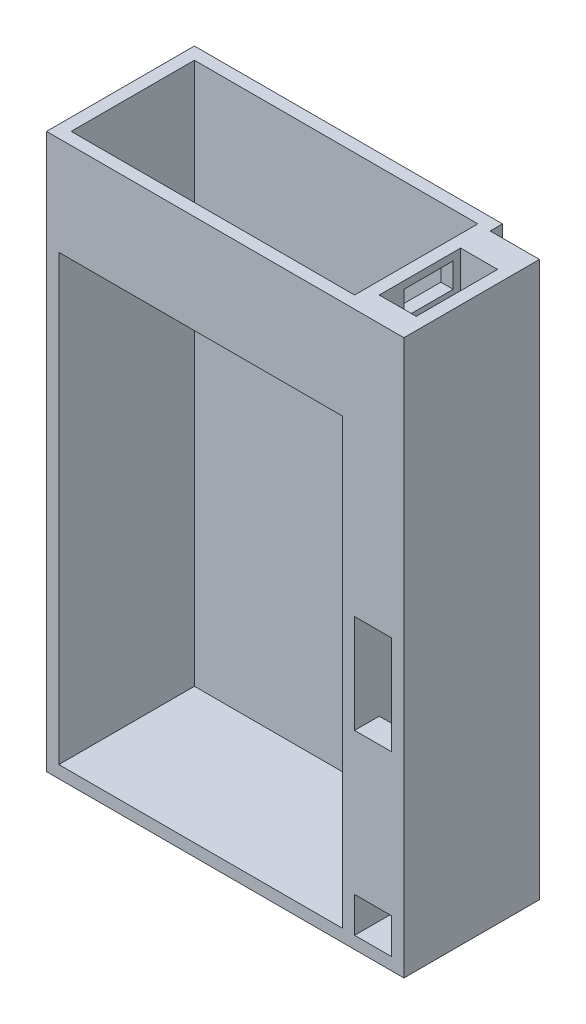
ISO-10303-21;
HEADER;
FILE_DESCRIPTION(('STEP AP214'),'2;1');
FILE_NAME('part.step','',(''),(''),'','','');
FILE_SCHEMA(('AUTOMOTIVE_DESIGN { 1 0 10303 214 1 1 1 1 }'));
ENDSEC;
DATA;
#1=APPLICATION_CONTEXT('core data for automotive mechanical design processes');
#2=APPLICATION_PROTOCOL_DEFINITION('international standard','automotive_design',2000,#1);
#3=PRODUCT_CONTEXT('',#1,'mechanical');
#4=PRODUCT('Part','Part','',(#3));
#5=PRODUCT_RELATED_PRODUCT_CATEGORY('part','',(#4));
#6=PRODUCT_DEFINITION_FORMATION('','',#4);
#7=PRODUCT_DEFINITION_CONTEXT('part definition',#1,'design');
#8=PRODUCT_DEFINITION('design','',#6,#7);
#9=PRODUCT_DEFINITION_SHAPE('','',#8);
#10=(LENGTH_UNIT() NAMED_UNIT(*) SI_UNIT(.MILLI.,.METRE.));
#11=(NAMED_UNIT(*) PLANE_ANGLE_UNIT() SI_UNIT($,.RADIAN.));
#12=(NAMED_UNIT(*) SI_UNIT($,.STERADIAN.) SOLID_ANGLE_UNIT());
#13=UNCERTAINTY_MEASURE_WITH_UNIT(LENGTH_MEASURE(1.E-05),#10,'distance_accuracy_value','');
#14=(GEOMETRIC_REPRESENTATION_CONTEXT(3) GLOBAL_UNCERTAINTY_ASSIGNED_CONTEXT((#13)) GLOBAL_UNIT_ASSIGNED_CONTEXT((#10,
#11,#12)) REPRESENTATION_CONTEXT('',''));
#15=CARTESIAN_POINT('',(0.,0.,0.));
#16=DIRECTION('',(0.,0.,1.));
#17=DIRECTION('',(1.,0.,0.));
#18=AXIS2_PLACEMENT_3D('',#15,#16,#17);
#19=CARTESIAN_POINT('',(62.5,-112.5,55.));
#20=DIRECTION('',(-1.,0.,0.));
#21=DIRECTION('',(0.,-1.,0.));
#22=AXIS2_PLACEMENT_3D('',#19,#20,#21);
#23=PLANE('',#22);
#24=DIRECTION('',(0.,-1.,0.));
#25=VECTOR('',#24,1.);
#26=CARTESIAN_POINT('',(62.5,112.5,45.));
#27=LINE('',#26,#25);
#28=CARTESIAN_POINT('',(62.5,112.5,45.));
#29=VERTEX_POINT('',#28);
#30=CARTESIAN_POINT('',(62.5,4.49999999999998,45.));
#31=VERTEX_POINT('',#30);
#32=EDGE_CURVE('E216',#29,#31,#27,.T.);
#33=ORIENTED_EDGE('',*,*,#32,.T.);
#34=DIRECTION('',(0.,0.,1.));
#35=VECTOR('',#34,1.);
#36=CARTESIAN_POINT('',(62.5,4.49999999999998,45.));
#37=LINE('',#36,#35);
#38=CARTESIAN_POINT('',(62.5,4.49999999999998,55.));
#39=VERTEX_POINT('',#38);
#40=EDGE_CURVE('E210',#31,#39,#37,.T.);
#41=ORIENTED_EDGE('',*,*,#40,.T.);
#42=DIRECTION('',(0.,1.,0.));
#43=VECTOR('',#42,1.);
#44=CARTESIAN_POINT('',(62.5,-112.5,55.));
#45=LINE('',#44,#43);
#46=CARTESIAN_POINT('',(62.5,-35.5,55.));
#47=VERTEX_POINT('',#46);
#48=EDGE_CURVE('E223',#47,#39,#45,.T.);
#49=ORIENTED_EDGE('',*,*,#48,.F.);
#50=DIRECTION('',(0.,0.,1.));
#51=VECTOR('',#50,1.);
#52=CARTESIAN_POINT('',(62.5,-35.5,45.));
#53=LINE('',#52,#51);
#54=CARTESIAN_POINT('',(62.5,-35.5,45.));
#55=VERTEX_POINT('',#54);
#56=EDGE_CURVE('E354',#55,#47,#53,.T.);
#57=ORIENTED_EDGE('',*,*,#56,.F.);
#58=DIRECTION('',(0.,-1.,0.));
#59=VECTOR('',#58,1.);
#60=CARTESIAN_POINT('',(62.5,-35.5,45.));
#61=LINE('',#60,#59);
#62=CARTESIAN_POINT('',(62.5,-93.134438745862,45.));
#63=VERTEX_POINT('',#62);
#64=EDGE_CURVE('E711',#55,#63,#61,.T.);
#65=ORIENTED_EDGE('',*,*,#64,.T.);
#66=DIRECTION('',(0.,0.,1.));
#67=VECTOR('',#66,1.);
#68=CARTESIAN_POINT('',(62.5,-93.134438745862,45.));
#69=LINE('',#68,#67);
#70=CARTESIAN_POINT('',(62.5,-93.134438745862,55.));
#71=VERTEX_POINT('',#70);
#72=EDGE_CURVE('E346',#63,#71,#69,.T.);
#73=ORIENTED_EDGE('',*,*,#72,.T.);
#74=CARTESIAN_POINT('',(62.5,-107.5,55.));
#75=VERTEX_POINT('',#74);
#76=EDGE_CURVE('E229',#75,#71,#45,.T.);
#77=ORIENTED_EDGE('',*,*,#76,.F.);
#78=DIRECTION('',(0.,0.,-1.));
#79=VECTOR('',#78,1.);
#80=CARTESIAN_POINT('',(62.5,-107.5,55.));
#81=LINE('',#80,#79);
#82=CARTESIAN_POINT('',(62.5,-107.5,12.));
#83=VERTEX_POINT('',#82);
#84=EDGE_CURVE('E352',#75,#83,#81,.T.);
#85=ORIENTED_EDGE('',*,*,#84,.T.);
#86=DIRECTION('',(0.,-1.,0.));
#87=VECTOR('',#86,1.);
#88=CARTESIAN_POINT('',(62.5,-112.5,12.));
#89=LINE('',#88,#87);
#90=CARTESIAN_POINT('',(62.5,112.5,12.));
#91=VERTEX_POINT('',#90);
#92=EDGE_CURVE('E364',#91,#83,#89,.T.);
#93=ORIENTED_EDGE('',*,*,#92,.F.);
#94=DIRECTION('',(0.,0.,-1.));
#95=VECTOR('',#94,1.);
#96=CARTESIAN_POINT('',(62.5,112.5,55.));
#97=LINE('',#96,#95);
#98=EDGE_CURVE('E251',#29,#91,#97,.T.);
#99=ORIENTED_EDGE('',*,*,#98,.F.);
#100=EDGE_LOOP('',(#33,#41,#49,#57,#65,#73,#77,#85,#93,#99));
#101=FACE_BOUND('',#100,.T.);
#102=DIRECTION('',(0.,0.,-1.));
#103=VECTOR('',#102,1.);
#104=CARTESIAN_POINT('',(62.5,99.5,35.));
#105=LINE('',#104,#103);
#106=CARTESIAN_POINT('',(62.5,99.5,35.));
#107=VERTEX_POINT('',#106);
#108=CARTESIAN_POINT('',(62.5,99.5,15.));
#109=VERTEX_POINT('',#108);
#110=EDGE_CURVE('E392',#107,#109,#105,.T.);
#111=ORIENTED_EDGE('',*,*,#110,.F.);
#112=DIRECTION('',(0.,-1.,0.));
#113=VECTOR('',#112,1.);
#114=CARTESIAN_POINT('',(62.5,99.5,35.));
#115=LINE('',#114,#113);
#116=CARTESIAN_POINT('',(62.5,109.5,35.));
#117=VERTEX_POINT('',#116);
#118=EDGE_CURVE('E330',#117,#107,#115,.T.);
#119=ORIENTED_EDGE('',*,*,#118,.F.);
#120=DIRECTION('',(0.,0.,1.));
#121=VECTOR('',#120,1.);
#122=CARTESIAN_POINT('',(62.5,109.5,35.));
#123=LINE('',#122,#121);
#124=CARTESIAN_POINT('',(62.5,109.5,15.));
#125=VERTEX_POINT('',#124);
#126=EDGE_CURVE('E381',#125,#117,#123,.T.);
#127=ORIENTED_EDGE('',*,*,#126,.F.);
#128=DIRECTION('',(0.,1.,0.));
#129=VECTOR('',#128,1.);
#130=CARTESIAN_POINT('',(62.5,99.5,15.));
#131=LINE('',#130,#129);
#132=EDGE_CURVE('E395',#109,#125,#131,.T.);
#133=ORIENTED_EDGE('',*,*,#132,.F.);
#134=EDGE_LOOP('',(#111,#119,#127,#133));
#135=FACE_BOUND('',#134,.T.);
#136=ADVANCED_FACE('F37',(#101,#135),#23,.F.);
#137=CARTESIAN_POINT('',(0.,0.,12.));
#138=DIRECTION('',(0.,0.,-1.));
#139=DIRECTION('',(-1.,0.,0.));
#140=AXIS2_PLACEMENT_3D('',#137,#138,#139);
#141=PLANE('',#140);
#142=DIRECTION('',(0.,-1.,0.));
#143=VECTOR('',#142,1.);
#144=CARTESIAN_POINT('',(77.5,-107.5,12.));
#145=LINE('',#144,#143);
#146=CARTESIAN_POINT('',(77.5,112.5,12.));
#147=VERTEX_POINT('',#146);
#148=CARTESIAN_POINT('',(77.5,-107.5,12.));
#149=VERTEX_POINT('',#148);
#150=EDGE_CURVE('E343',#147,#149,#145,.T.);
#151=ORIENTED_EDGE('',*,*,#150,.F.);
#152=DIRECTION('',(-1.,0.,0.));
#153=VECTOR('',#152,1.);
#154=CARTESIAN_POINT('',(62.5,112.5,12.));
#155=LINE('',#154,#153);
#156=EDGE_CURVE('E366',#147,#91,#155,.T.);
#157=ORIENTED_EDGE('',*,*,#156,.T.);
#158=ORIENTED_EDGE('',*,*,#92,.T.);
#159=DIRECTION('',(-1.,0.,0.));
#160=VECTOR('',#159,1.);
#161=CARTESIAN_POINT('',(62.5,-107.5,12.));
#162=LINE('',#161,#160);
#163=EDGE_CURVE('E338',#149,#83,#162,.T.);
#164=ORIENTED_EDGE('',*,*,#163,.F.);
#165=EDGE_LOOP('',(#151,#157,#158,#164));
#166=FACE_BOUND('',#165,.T.);
#167=ADVANCED_FACE('F441',(#166),#141,.F.);
#168=CARTESIAN_POINT('',(57.5,-107.5,55.));
#169=DIRECTION('',(1.,0.,0.));
#170=DIRECTION('',(0.,0.,-1.));
#171=AXIS2_PLACEMENT_3D('',#168,#169,#170);
#172=PLANE('',#171);
#173=DIRECTION('',(0.,0.,1.));
#174=VECTOR('',#173,1.);
#175=CARTESIAN_POINT('',(57.5,109.5,35.));
#176=LINE('',#175,#174);
#177=CARTESIAN_POINT('',(57.5,109.5,15.));
#178=VERTEX_POINT('',#177);
#179=CARTESIAN_POINT('',(57.5,109.5,35.));
#180=VERTEX_POINT('',#179);
#181=EDGE_CURVE('E387',#178,#180,#176,.T.);
#182=ORIENTED_EDGE('',*,*,#181,.T.);
#183=DIRECTION('',(0.,-1.,0.));
#184=VECTOR('',#183,1.);
#185=CARTESIAN_POINT('',(57.5,99.5,35.));
#186=LINE('',#185,#184);
#187=CARTESIAN_POINT('',(57.5,99.5,35.));
#188=VERTEX_POINT('',#187);
#189=EDGE_CURVE('E377',#180,#188,#186,.T.);
#190=ORIENTED_EDGE('',*,*,#189,.T.);
#191=DIRECTION('',(0.,0.,-1.));
#192=VECTOR('',#191,1.);
#193=CARTESIAN_POINT('',(57.5,99.5,35.));
#194=LINE('',#193,#192);
#195=CARTESIAN_POINT('',(57.5,99.5,15.));
#196=VERTEX_POINT('',#195);
#197=EDGE_CURVE('E380',#188,#196,#194,.T.);
#198=ORIENTED_EDGE('',*,*,#197,.T.);
#199=DIRECTION('',(0.,1.,0.));
#200=VECTOR('',#199,1.);
#201=CARTESIAN_POINT('',(57.5,99.5,15.));
#202=LINE('',#201,#200);
#203=EDGE_CURVE('E384',#196,#178,#202,.T.);
#204=ORIENTED_EDGE('',*,*,#203,.T.);
#205=EDGE_LOOP('',(#182,#190,#198,#204));
#206=FACE_BOUND('',#205,.T.);
#207=DIRECTION('',(0.,-1.,0.));
#208=VECTOR('',#207,1.);
#209=CARTESIAN_POINT('',(57.5,107.5,55.));
#210=LINE('',#209,#208);
#211=CARTESIAN_POINT('',(57.5,72.5,55.));
#212=VERTEX_POINT('',#211);
#213=CARTESIAN_POINT('',(57.5,-107.5,55.));
#214=VERTEX_POINT('',#213);
#215=EDGE_CURVE('E248',#212,#214,#210,.T.);
#216=ORIENTED_EDGE('',*,*,#215,.F.);
#217=DIRECTION('',(0.,0.,-1.));
#218=VECTOR('',#217,1.);
#219=CARTESIAN_POINT('',(57.5,72.5,55.));
#220=LINE('',#219,#218);
#221=CARTESIAN_POINT('',(57.5,72.5,50.));
#222=VERTEX_POINT('',#221);
#223=EDGE_CURVE('E416',#212,#222,#220,.T.);
#224=ORIENTED_EDGE('',*,*,#223,.T.);
#225=DIRECTION('',(0.,-1.,0.));
#226=VECTOR('',#225,1.);
#227=CARTESIAN_POINT('',(57.5,-107.5,50.));
#228=LINE('',#227,#226);
#229=CARTESIAN_POINT('',(57.5,112.5,50.));
#230=VERTEX_POINT('',#229);
#231=EDGE_CURVE('E285',#230,#222,#228,.T.);
#232=ORIENTED_EDGE('',*,*,#231,.F.);
#233=DIRECTION('',(0.,0.,-1.));
#234=VECTOR('',#233,1.);
#235=CARTESIAN_POINT('',(57.5,112.5,55.));
#236=LINE('',#235,#234);
#237=CARTESIAN_POINT('',(57.5,112.5,0.));
#238=VERTEX_POINT('',#237);
#239=EDGE_CURVE('E233',#230,#238,#236,.T.);
#240=ORIENTED_EDGE('',*,*,#239,.T.);
#241=DIRECTION('',(0.,-1.,0.));
#242=VECTOR('',#241,1.);
#243=CARTESIAN_POINT('',(57.5,-107.5,0.));
#244=LINE('',#243,#242);
#245=CARTESIAN_POINT('',(57.5,-107.5,0.));
#246=VERTEX_POINT('',#245);
#247=EDGE_CURVE('E238',#238,#246,#244,.T.);
#248=ORIENTED_EDGE('',*,*,#247,.T.);
#249=DIRECTION('',(0.,0.,-1.));
#250=VECTOR('',#249,1.);
#251=CARTESIAN_POINT('',(57.5,-107.5,55.));
#252=LINE('',#251,#250);
#253=EDGE_CURVE('E11',#214,#246,#252,.T.);
#254=ORIENTED_EDGE('',*,*,#253,.F.);
#255=EDGE_LOOP('',(#216,#224,#232,#240,#248,#254));
#256=FACE_BOUND('',#255,.T.);
#257=ADVANCED_FACE('F39',(#206,#256),#172,.F.);
#258=CARTESIAN_POINT('',(-57.5,-107.5,55.));
#259=DIRECTION('',(0.,-1.,0.));
#260=DIRECTION('',(0.,0.,-1.));
#261=AXIS2_PLACEMENT_3D('',#258,#259,#260);
#262=PLANE('',#261);
#263=DIRECTION('',(-1.,0.,0.));
#264=VECTOR('',#263,1.);
#265=CARTESIAN_POINT('',(-57.5,-107.5,0.));
#266=LINE('',#265,#264);
#267=CARTESIAN_POINT('',(-57.5,-107.5,0.));
#268=VERTEX_POINT('',#267);
#269=EDGE_CURVE('E241',#246,#268,#266,.T.);
#270=ORIENTED_EDGE('',*,*,#269,.T.);
#271=DIRECTION('',(0.,0.,-1.));
#272=VECTOR('',#271,1.);
#273=CARTESIAN_POINT('',(-57.5,-107.5,55.));
#274=LINE('',#273,#272);
#275=CARTESIAN_POINT('',(-57.5,-107.5,55.));
#276=VERTEX_POINT('',#275);
#277=EDGE_CURVE('E45',#276,#268,#274,.T.);
#278=ORIENTED_EDGE('',*,*,#277,.F.);
#279=DIRECTION('',(-1.,0.,0.));
#280=VECTOR('',#279,1.);
#281=CARTESIAN_POINT('',(-57.5,-107.5,55.));
#282=LINE('',#281,#280);
#283=EDGE_CURVE('E273',#214,#276,#282,.T.);
#284=ORIENTED_EDGE('',*,*,#283,.F.);
#285=ORIENTED_EDGE('',*,*,#253,.T.);
#286=EDGE_LOOP('',(#270,#278,#284,#285));
#287=FACE_BOUND('',#286,.T.);
#288=ADVANCED_FACE('F272',(#287),#262,.F.);
#289=CARTESIAN_POINT('',(-57.5,107.5,55.));
#290=DIRECTION('',(-1.,0.,0.));
#291=DIRECTION('',(0.,-1.,0.));
#292=AXIS2_PLACEMENT_3D('',#289,#290,#291);
#293=PLANE('',#292);
#294=DIRECTION('',(0.,1.,0.));
#295=VECTOR('',#294,1.);
#296=CARTESIAN_POINT('',(-57.5,107.5,50.));
#297=LINE('',#296,#295);
#298=CARTESIAN_POINT('',(-57.5,72.5,50.));
#299=VERTEX_POINT('',#298);
#300=CARTESIAN_POINT('',(-57.5,112.5,50.));
#301=VERTEX_POINT('',#300);
#302=EDGE_CURVE('E297',#299,#301,#297,.T.);
#303=ORIENTED_EDGE('',*,*,#302,.F.);
#304=DIRECTION('',(0.,0.,1.));
#305=VECTOR('',#304,1.);
#306=CARTESIAN_POINT('',(-57.4999999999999,72.5,55.));
#307=LINE('',#306,#305);
#308=CARTESIAN_POINT('',(-57.5,72.5,55.));
#309=VERTEX_POINT('',#308);
#310=EDGE_CURVE('E413',#299,#309,#307,.T.);
#311=ORIENTED_EDGE('',*,*,#310,.T.);
#312=DIRECTION('',(0.,1.,0.));
#313=VECTOR('',#312,1.);
#314=CARTESIAN_POINT('',(-57.5,-107.5,55.));
#315=LINE('',#314,#313);
#316=EDGE_CURVE('E269',#276,#309,#315,.T.);
#317=ORIENTED_EDGE('',*,*,#316,.F.);
#318=ORIENTED_EDGE('',*,*,#277,.T.);
#319=DIRECTION('',(0.,1.,0.));
#320=VECTOR('',#319,1.);
#321=CARTESIAN_POINT('',(-57.5,107.5,0.));
#322=LINE('',#321,#320);
#323=CARTESIAN_POINT('',(-57.5,112.5,0.));
#324=VERTEX_POINT('',#323);
#325=EDGE_CURVE('E245',#268,#324,#322,.T.);
#326=ORIENTED_EDGE('',*,*,#325,.T.);
#327=DIRECTION('',(0.,0.,-1.));
#328=VECTOR('',#327,1.);
#329=CARTESIAN_POINT('',(-57.5,112.5,55.));
#330=LINE('',#329,#328);
#331=EDGE_CURVE('E259',#301,#324,#330,.T.);
#332=ORIENTED_EDGE('',*,*,#331,.F.);
#333=EDGE_LOOP('',(#303,#311,#317,#318,#326,#332));
#334=FACE_BOUND('',#333,.T.);
#335=ADVANCED_FACE('F265',(#334),#293,.F.);
#336=CARTESIAN_POINT('',(-62.5,-112.5,55.));
#337=DIRECTION('',(1.,0.,0.));
#338=DIRECTION('',(0.,0.,-1.));
#339=AXIS2_PLACEMENT_3D('',#336,#337,#338);
#340=PLANE('',#339);
#341=DIRECTION('',(0.,0.,-1.));
#342=VECTOR('',#341,1.);
#343=CARTESIAN_POINT('',(-62.5,-112.5,55.));
#344=LINE('',#343,#342);
#345=CARTESIAN_POINT('',(-62.5,-112.5,55.));
#346=VERTEX_POINT('',#345);
#347=CARTESIAN_POINT('',(-62.5,-112.5,-5.));
#348=VERTEX_POINT('',#347);
#349=EDGE_CURVE('E255',#346,#348,#344,.T.);
#350=ORIENTED_EDGE('',*,*,#349,.F.);
#351=DIRECTION('',(0.,-1.,0.));
#352=VECTOR('',#351,1.);
#353=CARTESIAN_POINT('',(-62.5,-112.5,55.));
#354=LINE('',#353,#352);
#355=CARTESIAN_POINT('',(-62.5,112.5,55.));
#356=VERTEX_POINT('',#355);
#357=EDGE_CURVE('E234',#356,#346,#354,.T.);
#358=ORIENTED_EDGE('',*,*,#357,.F.);
#359=DIRECTION('',(0.,0.,-1.));
#360=VECTOR('',#359,1.);
#361=CARTESIAN_POINT('',(-62.5,112.5,55.));
#362=LINE('',#361,#360);
#363=CARTESIAN_POINT('',(-62.5,112.5,-5.));
#364=VERTEX_POINT('',#363);
#365=EDGE_CURVE('E257',#356,#364,#362,.T.);
#366=ORIENTED_EDGE('',*,*,#365,.T.);
#367=DIRECTION('',(0.,-1.,0.));
#368=VECTOR('',#367,1.);
#369=CARTESIAN_POINT('',(-62.5,-112.5,-5.));
#370=LINE('',#369,#368);
#371=EDGE_CURVE('E317',#364,#348,#370,.T.);
#372=ORIENTED_EDGE('',*,*,#371,.T.);
#373=EDGE_LOOP('',(#350,#358,#366,#372));
#374=FACE_BOUND('',#373,.T.);
#375=ADVANCED_FACE('F315',(#374),#340,.F.);
#376=CARTESIAN_POINT('',(-62.5,-112.5,55.));
#377=DIRECTION('',(0.,1.,0.));
#378=DIRECTION('',(0.,0.,1.));
#379=AXIS2_PLACEMENT_3D('',#376,#377,#378);
#380=PLANE('',#379);
#381=ORIENTED_EDGE('',*,*,#349,.T.);
#382=DIRECTION('',(1.,0.,0.));
#383=VECTOR('',#382,1.);
#384=CARTESIAN_POINT('',(-62.5,-112.5,-5.));
#385=LINE('',#384,#383);
#386=CARTESIAN_POINT('',(62.5,-112.5,-5.));
#387=VERTEX_POINT('',#386);
#388=EDGE_CURVE('E242',#348,#387,#385,.T.);
#389=ORIENTED_EDGE('',*,*,#388,.T.);
#390=DIRECTION('',(0.,0.,-1.));
#391=VECTOR('',#390,1.);
#392=CARTESIAN_POINT('',(62.5,-112.5,55.));
#393=LINE('',#392,#391);
#394=CARTESIAN_POINT('',(62.5,-112.5,0.));
#395=VERTEX_POINT('',#394);
#396=EDGE_CURVE('E253',#395,#387,#393,.T.);
#397=ORIENTED_EDGE('',*,*,#396,.F.);
#398=DIRECTION('',(1.,0.,0.));
#399=VECTOR('',#398,1.);
#400=CARTESIAN_POINT('',(82.5,-112.5,0.));
#401=LINE('',#400,#399);
#402=CARTESIAN_POINT('',(82.5,-112.5,0.));
#403=VERTEX_POINT('',#402);
#404=EDGE_CURVE('E327',#395,#403,#401,.T.);
#405=ORIENTED_EDGE('',*,*,#404,.T.);
#406=DIRECTION('',(0.,0.,-1.));
#407=VECTOR('',#406,1.);
#408=CARTESIAN_POINT('',(82.5,-112.5,12.));
#409=LINE('',#408,#407);
#410=CARTESIAN_POINT('',(82.5,-112.5,55.));
#411=VERTEX_POINT('',#410);
#412=EDGE_CURVE('E323',#411,#403,#409,.T.);
#413=ORIENTED_EDGE('',*,*,#412,.F.);
#414=DIRECTION('',(1.,0.,0.));
#415=VECTOR('',#414,1.);
#416=CARTESIAN_POINT('',(-62.5,-112.5,55.));
#417=LINE('',#416,#415);
#418=EDGE_CURVE('E230',#346,#411,#417,.T.);
#419=ORIENTED_EDGE('',*,*,#418,.F.);
#420=EDGE_LOOP('',(#381,#389,#397,#405,#413,#419));
#421=FACE_BOUND('',#420,.T.);
#422=ADVANCED_FACE('F321',(#421),#380,.F.);
#423=CARTESIAN_POINT('',(62.5,112.5,0.));
#424=VERTEX_POINT('',#423);
#425=CARTESIAN_POINT('',(62.5,112.5,-5.));
#426=VERTEX_POINT('',#425);
#427=EDGE_CURVE('E250',#424,#426,#97,.T.);
#428=ORIENTED_EDGE('',*,*,#427,.F.);
#429=DIRECTION('',(0.,-1.,0.));
#430=VECTOR('',#429,1.);
#431=CARTESIAN_POINT('',(62.5,-112.5,0.));
#432=LINE('',#431,#430);
#433=EDGE_CURVE('E363',#424,#395,#432,.T.);
#434=ORIENTED_EDGE('',*,*,#433,.T.);
#435=ORIENTED_EDGE('',*,*,#396,.T.);
#436=DIRECTION('',(0.,1.,0.));
#437=VECTOR('',#436,1.);
#438=CARTESIAN_POINT('',(62.5,-112.5,-5.));
#439=LINE('',#438,#437);
#440=EDGE_CURVE('E292',#387,#426,#439,.T.);
#441=ORIENTED_EDGE('',*,*,#440,.T.);
#442=EDGE_LOOP('',(#428,#434,#435,#441));
#443=FACE_BOUND('',#442,.T.);
#444=ADVANCED_FACE('F425',(#443),#23,.F.);
#445=CARTESIAN_POINT('',(57.5,112.5,55.));
#446=DIRECTION('',(0.,-1.,0.));
#447=DIRECTION('',(0.,0.,-1.));
#448=AXIS2_PLACEMENT_3D('',#445,#446,#447);
#449=PLANE('',#448);
#450=DIRECTION('',(-1.,0.,0.));
#451=VECTOR('',#450,1.);
#452=CARTESIAN_POINT('',(77.5,112.5,45.));
#453=LINE('',#452,#451);
#454=CARTESIAN_POINT('',(77.5,112.5,45.));
#455=VERTEX_POINT('',#454);
#456=EDGE_CURVE('E225',#455,#29,#453,.T.);
#457=ORIENTED_EDGE('',*,*,#456,.T.);
#458=ORIENTED_EDGE('',*,*,#98,.T.);
#459=ORIENTED_EDGE('',*,*,#156,.F.);
#460=DIRECTION('',(0.,0.,-1.));
#461=VECTOR('',#460,1.);
#462=CARTESIAN_POINT('',(77.5,112.5,55.));
#463=LINE('',#462,#461);
#464=EDGE_CURVE('E361',#455,#147,#463,.T.);
#465=ORIENTED_EDGE('',*,*,#464,.F.);
#466=EDGE_LOOP('',(#457,#458,#459,#465));
#467=FACE_BOUND('',#466,.T.);
#468=ORIENTED_EDGE('',*,*,#239,.F.);
#469=DIRECTION('',(-1.,0.,0.));
#470=VECTOR('',#469,1.);
#471=CARTESIAN_POINT('',(-62.5,112.5,50.));
#472=LINE('',#471,#470);
#473=EDGE_CURVE('E290',#230,#301,#472,.T.);
#474=ORIENTED_EDGE('',*,*,#473,.T.);
#475=ORIENTED_EDGE('',*,*,#331,.T.);
#476=DIRECTION('',(-1.,0.,0.));
#477=VECTOR('',#476,1.);
#478=CARTESIAN_POINT('',(-62.5,112.5,0.));
#479=LINE('',#478,#477);
#480=EDGE_CURVE('E291',#238,#324,#479,.T.);
#481=ORIENTED_EDGE('',*,*,#480,.F.);
#482=EDGE_LOOP('',(#468,#474,#475,#481));
#483=FACE_BOUND('',#482,.T.);
#484=DIRECTION('',(-1.,0.,0.));
#485=VECTOR('',#484,1.);
#486=CARTESIAN_POINT('',(-62.5,112.5,55.));
#487=LINE('',#486,#485);
#488=CARTESIAN_POINT('',(82.5,112.5,55.));
#489=VERTEX_POINT('',#488);
#490=EDGE_CURVE('E305',#489,#356,#487,.T.);
#491=ORIENTED_EDGE('',*,*,#490,.F.);
#492=DIRECTION('',(0.,0.,-1.));
#493=VECTOR('',#492,1.);
#494=CARTESIAN_POINT('',(82.5,112.5,12.));
#495=LINE('',#494,#493);
#496=CARTESIAN_POINT('',(82.5,112.5,0.));
#497=VERTEX_POINT('',#496);
#498=EDGE_CURVE('E331',#489,#497,#495,.T.);
#499=ORIENTED_EDGE('',*,*,#498,.T.);
#500=DIRECTION('',(-1.,0.,0.));
#501=VECTOR('',#500,1.);
#502=CARTESIAN_POINT('',(62.5,112.5,0.));
#503=LINE('',#502,#501);
#504=EDGE_CURVE('E367',#497,#424,#503,.T.);
#505=ORIENTED_EDGE('',*,*,#504,.T.);
#506=ORIENTED_EDGE('',*,*,#427,.T.);
#507=DIRECTION('',(-1.,0.,0.));
#508=VECTOR('',#507,1.);
#509=CARTESIAN_POINT('',(-62.5,112.5,-5.));
#510=LINE('',#509,#508);
#511=EDGE_CURVE('E295',#426,#364,#510,.T.);
#512=ORIENTED_EDGE('',*,*,#511,.T.);
#513=ORIENTED_EDGE('',*,*,#365,.F.);
#514=EDGE_LOOP('',(#491,#499,#505,#506,#512,#513));
#515=FACE_BOUND('',#514,.T.);
#516=ADVANCED_FACE('F288',(#467,#483,#515),#449,.F.);
#517=CARTESIAN_POINT('',(0.,0.,55.));
#518=DIRECTION('',(0.,0.,-1.));
#519=DIRECTION('',(-1.,0.,0.));
#520=AXIS2_PLACEMENT_3D('',#517,#518,#519);
#521=PLANE('',#520);
#522=ORIENTED_EDGE('',*,*,#48,.T.);
#523=DIRECTION('',(1.,0.,0.));
#524=VECTOR('',#523,1.);
#525=CARTESIAN_POINT('',(62.5,4.49999999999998,55.));
#526=LINE('',#525,#524);
#527=CARTESIAN_POINT('',(77.5,4.49999999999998,55.));
#528=VERTEX_POINT('',#527);
#529=EDGE_CURVE('E52',#39,#528,#526,.T.);
#530=ORIENTED_EDGE('',*,*,#529,.T.);
#531=DIRECTION('',(0.,-1.,0.));
#532=VECTOR('',#531,1.);
#533=CARTESIAN_POINT('',(77.5,-107.5,55.));
#534=LINE('',#533,#532);
#535=CARTESIAN_POINT('',(77.5,-35.5,55.));
#536=VERTEX_POINT('',#535);
#537=EDGE_CURVE('E340',#528,#536,#534,.T.);
#538=ORIENTED_EDGE('',*,*,#537,.T.);
#539=DIRECTION('',(-1.,0.,0.));
#540=VECTOR('',#539,1.);
#541=CARTESIAN_POINT('',(77.5,-35.5,55.));
#542=LINE('',#541,#540);
#543=EDGE_CURVE('E57',#536,#47,#542,.T.);
#544=ORIENTED_EDGE('',*,*,#543,.T.);
#545=EDGE_LOOP('',(#522,#530,#538,#544));
#546=FACE_BOUND('',#545,.T.);
#547=ORIENTED_EDGE('',*,*,#76,.T.);
#548=DIRECTION('',(1.,0.,0.));
#549=VECTOR('',#548,1.);
#550=CARTESIAN_POINT('',(62.5,-93.134438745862,55.));
#551=LINE('',#550,#549);
#552=CARTESIAN_POINT('',(77.5,-93.134438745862,55.));
#553=VERTEX_POINT('',#552);
#554=EDGE_CURVE('E215',#71,#553,#551,.T.);
#555=ORIENTED_EDGE('',*,*,#554,.T.);
#556=CARTESIAN_POINT('',(77.5,-107.5,55.));
#557=VERTEX_POINT('',#556);
#558=EDGE_CURVE('E337',#553,#557,#534,.T.);
#559=ORIENTED_EDGE('',*,*,#558,.T.);
#560=DIRECTION('',(-1.,0.,0.));
#561=VECTOR('',#560,1.);
#562=CARTESIAN_POINT('',(62.5,-107.5,55.));
#563=LINE('',#562,#561);
#564=EDGE_CURVE('E349',#557,#75,#563,.T.);
#565=ORIENTED_EDGE('',*,*,#564,.T.);
#566=EDGE_LOOP('',(#547,#555,#559,#565));
#567=FACE_BOUND('',#566,.T.);
#568=DIRECTION('',(1.,0.,0.));
#569=VECTOR('',#568,1.);
#570=CARTESIAN_POINT('',(-62.5,72.5,55.));
#571=LINE('',#570,#569);
#572=EDGE_CURVE('E402',#309,#212,#571,.T.);
#573=ORIENTED_EDGE('',*,*,#572,.T.);
#574=ORIENTED_EDGE('',*,*,#215,.T.);
#575=ORIENTED_EDGE('',*,*,#283,.T.);
#576=ORIENTED_EDGE('',*,*,#316,.T.);
#577=EDGE_LOOP('',(#573,#574,#575,#576));
#578=FACE_BOUND('',#577,.T.);
#579=ORIENTED_EDGE('',*,*,#418,.T.);
#580=DIRECTION('',(0.,1.,0.));
#581=VECTOR('',#580,1.);
#582=CARTESIAN_POINT('',(82.5,-112.5,55.));
#583=LINE('',#582,#581);
#584=EDGE_CURVE('E334',#411,#489,#583,.T.);
#585=ORIENTED_EDGE('',*,*,#584,.T.);
#586=ORIENTED_EDGE('',*,*,#490,.T.);
#587=ORIENTED_EDGE('',*,*,#357,.T.);
#588=EDGE_LOOP('',(#579,#585,#586,#587));
#589=FACE_BOUND('',#588,.T.);
#590=ADVANCED_FACE('F227',(#546,#567,#578,#589),#521,.F.);
#591=CARTESIAN_POINT('',(0.,0.,-5.));
#592=DIRECTION('',(0.,0.,-1.));
#593=DIRECTION('',(-1.,0.,0.));
#594=AXIS2_PLACEMENT_3D('',#591,#592,#593);
#595=PLANE('',#594);
#596=ORIENTED_EDGE('',*,*,#440,.F.);
#597=ORIENTED_EDGE('',*,*,#388,.F.);
#598=ORIENTED_EDGE('',*,*,#371,.F.);
#599=ORIENTED_EDGE('',*,*,#511,.F.);
#600=EDGE_LOOP('',(#596,#597,#598,#599));
#601=FACE_BOUND('',#600,.T.);
#602=ADVANCED_FACE('F422',(#601),#595,.T.);
#603=CARTESIAN_POINT('',(0.,0.,0.));
#604=DIRECTION('',(0.,0.,-1.));
#605=DIRECTION('',(-1.,0.,0.));
#606=AXIS2_PLACEMENT_3D('',#603,#604,#605);
#607=PLANE('',#606);
#608=ORIENTED_EDGE('',*,*,#247,.F.);
#609=ORIENTED_EDGE('',*,*,#480,.T.);
#610=ORIENTED_EDGE('',*,*,#325,.F.);
#611=ORIENTED_EDGE('',*,*,#269,.F.);
#612=EDGE_LOOP('',(#608,#609,#610,#611));
#613=FACE_BOUND('',#612,.T.);
#614=ADVANCED_FACE('F277',(#613),#607,.F.);
#615=CARTESIAN_POINT('',(0.,0.,50.));
#616=DIRECTION('',(0.,0.,1.));
#617=DIRECTION('',(1.,0.,0.));
#618=AXIS2_PLACEMENT_3D('',#615,#616,#617);
#619=PLANE('',#618);
#620=ORIENTED_EDGE('',*,*,#473,.F.);
#621=ORIENTED_EDGE('',*,*,#231,.T.);
#622=DIRECTION('',(1.,0.,0.));
#623=VECTOR('',#622,1.);
#624=CARTESIAN_POINT('',(-62.5,72.5,50.));
#625=LINE('',#624,#623);
#626=EDGE_CURVE('E409',#299,#222,#625,.T.);
#627=ORIENTED_EDGE('',*,*,#626,.F.);
#628=ORIENTED_EDGE('',*,*,#302,.T.);
#629=EDGE_LOOP('',(#620,#621,#627,#628));
#630=FACE_BOUND('',#629,.T.);
#631=ADVANCED_FACE('F489',(#630),#619,.F.);
#632=CARTESIAN_POINT('',(-62.5,72.5,50.));
#633=DIRECTION('',(0.,-1.,0.));
#634=DIRECTION('',(1.,0.,0.));
#635=AXIS2_PLACEMENT_3D('',#632,#633,#634);
#636=PLANE('',#635);
#637=ORIENTED_EDGE('',*,*,#223,.F.);
#638=ORIENTED_EDGE('',*,*,#572,.F.);
#639=ORIENTED_EDGE('',*,*,#310,.F.);
#640=ORIENTED_EDGE('',*,*,#626,.T.);
#641=EDGE_LOOP('',(#637,#638,#639,#640));
#642=FACE_BOUND('',#641,.T.);
#643=ADVANCED_FACE('F488',(#642),#636,.T.);
#644=CARTESIAN_POINT('',(57.5,99.5,35.));
#645=DIRECTION('',(0.,0.,1.));
#646=DIRECTION('',(1.,0.,0.));
#647=AXIS2_PLACEMENT_3D('',#644,#645,#646);
#648=PLANE('',#647);
#649=ORIENTED_EDGE('',*,*,#118,.T.);
#650=DIRECTION('',(1.,0.,0.));
#651=VECTOR('',#650,1.);
#652=CARTESIAN_POINT('',(57.5,99.5,35.));
#653=LINE('',#652,#651);
#654=EDGE_CURVE('E390',#188,#107,#653,.T.);
#655=ORIENTED_EDGE('',*,*,#654,.F.);
#656=ORIENTED_EDGE('',*,*,#189,.F.);
#657=DIRECTION('',(1.,0.,0.));
#658=VECTOR('',#657,1.);
#659=CARTESIAN_POINT('',(57.5,109.5,35.));
#660=LINE('',#659,#658);
#661=EDGE_CURVE('E400',#180,#117,#660,.T.);
#662=ORIENTED_EDGE('',*,*,#661,.T.);
#663=EDGE_LOOP('',(#649,#655,#656,#662));
#664=FACE_BOUND('',#663,.T.);
#665=ADVANCED_FACE('F467',(#664),#648,.F.);
#666=CARTESIAN_POINT('',(57.5,109.5,35.));
#667=DIRECTION('',(0.,1.,0.));
#668=DIRECTION('',(-1.,0.,0.));
#669=AXIS2_PLACEMENT_3D('',#666,#667,#668);
#670=PLANE('',#669);
#671=ORIENTED_EDGE('',*,*,#126,.T.);
#672=ORIENTED_EDGE('',*,*,#661,.F.);
#673=ORIENTED_EDGE('',*,*,#181,.F.);
#674=DIRECTION('',(1.,0.,0.));
#675=VECTOR('',#674,1.);
#676=CARTESIAN_POINT('',(57.5,109.5,15.));
#677=LINE('',#676,#675);
#678=EDGE_CURVE('E403',#178,#125,#677,.T.);
#679=ORIENTED_EDGE('',*,*,#678,.T.);
#680=EDGE_LOOP('',(#671,#672,#673,#679));
#681=FACE_BOUND('',#680,.T.);
#682=ADVANCED_FACE('F463',(#681),#670,.F.);
#683=CARTESIAN_POINT('',(57.5,99.5,15.));
#684=DIRECTION('',(0.,0.,-1.));
#685=DIRECTION('',(-1.,0.,0.));
#686=AXIS2_PLACEMENT_3D('',#683,#684,#685);
#687=PLANE('',#686);
#688=ORIENTED_EDGE('',*,*,#132,.T.);
#689=ORIENTED_EDGE('',*,*,#678,.F.);
#690=ORIENTED_EDGE('',*,*,#203,.F.);
#691=DIRECTION('',(1.,0.,0.));
#692=VECTOR('',#691,1.);
#693=CARTESIAN_POINT('',(57.5,99.5,15.));
#694=LINE('',#693,#692);
#695=EDGE_CURVE('E405',#196,#109,#694,.T.);
#696=ORIENTED_EDGE('',*,*,#695,.T.);
#697=EDGE_LOOP('',(#688,#689,#690,#696));
#698=FACE_BOUND('',#697,.T.);
#699=ADVANCED_FACE('F475',(#698),#687,.F.);
#700=CARTESIAN_POINT('',(57.5,99.5,35.));
#701=DIRECTION('',(0.,-1.,0.));
#702=DIRECTION('',(1.,0.,0.));
#703=AXIS2_PLACEMENT_3D('',#700,#701,#702);
#704=PLANE('',#703);
#705=ORIENTED_EDGE('',*,*,#110,.T.);
#706=ORIENTED_EDGE('',*,*,#695,.F.);
#707=ORIENTED_EDGE('',*,*,#197,.F.);
#708=ORIENTED_EDGE('',*,*,#654,.T.);
#709=EDGE_LOOP('',(#705,#706,#707,#708));
#710=FACE_BOUND('',#709,.T.);
#711=ADVANCED_FACE('F472',(#710),#704,.F.);
#712=CARTESIAN_POINT('',(82.5,112.5,12.));
#713=DIRECTION('',(-1.,0.,0.));
#714=DIRECTION('',(0.,-1.,0.));
#715=AXIS2_PLACEMENT_3D('',#712,#713,#714);
#716=PLANE('',#715);
#717=DIRECTION('',(0.,1.,0.));
#718=VECTOR('',#717,1.);
#719=CARTESIAN_POINT('',(82.5,112.5,0.));
#720=LINE('',#719,#718);
#721=EDGE_CURVE('E372',#403,#497,#720,.T.);
#722=ORIENTED_EDGE('',*,*,#721,.T.);
#723=ORIENTED_EDGE('',*,*,#498,.F.);
#724=ORIENTED_EDGE('',*,*,#584,.F.);
#725=ORIENTED_EDGE('',*,*,#412,.T.);
#726=EDGE_LOOP('',(#722,#723,#724,#725));
#727=FACE_BOUND('',#726,.T.);
#728=ADVANCED_FACE('F335',(#727),#716,.F.);
#729=CARTESIAN_POINT('',(0.,0.,0.));
#730=DIRECTION('',(0.,0.,-1.));
#731=DIRECTION('',(-1.,0.,0.));
#732=AXIS2_PLACEMENT_3D('',#729,#730,#731);
#733=PLANE('',#732);
#734=ORIENTED_EDGE('',*,*,#433,.F.);
#735=ORIENTED_EDGE('',*,*,#504,.F.);
#736=ORIENTED_EDGE('',*,*,#721,.F.);
#737=ORIENTED_EDGE('',*,*,#404,.F.);
#738=EDGE_LOOP('',(#734,#735,#736,#737));
#739=FACE_BOUND('',#738,.T.);
#740=ADVANCED_FACE('F429',(#739),#733,.T.);
#741=CARTESIAN_POINT('',(77.5,-107.5,55.));
#742=DIRECTION('',(1.,0.,0.));
#743=DIRECTION('',(0.,0.,-1.));
#744=AXIS2_PLACEMENT_3D('',#741,#742,#743);
#745=PLANE('',#744);
#746=ORIENTED_EDGE('',*,*,#537,.F.);
#747=DIRECTION('',(0.,0.,1.));
#748=VECTOR('',#747,1.);
#749=CARTESIAN_POINT('',(77.5,4.49999999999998,45.));
#750=LINE('',#749,#748);
#751=CARTESIAN_POINT('',(77.5,4.49999999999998,45.));
#752=VERTEX_POINT('',#751);
#753=EDGE_CURVE('E213',#752,#528,#750,.T.);
#754=ORIENTED_EDGE('',*,*,#753,.F.);
#755=DIRECTION('',(0.,1.,0.));
#756=VECTOR('',#755,1.);
#757=CARTESIAN_POINT('',(77.5,4.49999999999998,45.));
#758=LINE('',#757,#756);
#759=EDGE_CURVE('E688',#752,#455,#758,.T.);
#760=ORIENTED_EDGE('',*,*,#759,.T.);
#761=ORIENTED_EDGE('',*,*,#464,.T.);
#762=ORIENTED_EDGE('',*,*,#150,.T.);
#763=DIRECTION('',(0.,0.,-1.));
#764=VECTOR('',#763,1.);
#765=CARTESIAN_POINT('',(77.5,-107.5,55.));
#766=LINE('',#765,#764);
#767=EDGE_CURVE('E358',#557,#149,#766,.T.);
#768=ORIENTED_EDGE('',*,*,#767,.F.);
#769=ORIENTED_EDGE('',*,*,#558,.F.);
#770=DIRECTION('',(0.,0.,1.));
#771=VECTOR('',#770,1.);
#772=CARTESIAN_POINT('',(77.5,-93.134438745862,45.));
#773=LINE('',#772,#771);
#774=CARTESIAN_POINT('',(77.5,-93.134438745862,45.));
#775=VERTEX_POINT('',#774);
#776=EDGE_CURVE('E700',#775,#553,#773,.T.);
#777=ORIENTED_EDGE('',*,*,#776,.F.);
#778=DIRECTION('',(0.,1.,0.));
#779=VECTOR('',#778,1.);
#780=CARTESIAN_POINT('',(77.5,-93.134438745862,45.));
#781=LINE('',#780,#779);
#782=CARTESIAN_POINT('',(77.5,-35.5,45.));
#783=VERTEX_POINT('',#782);
#784=EDGE_CURVE('E702',#775,#783,#781,.T.);
#785=ORIENTED_EDGE('',*,*,#784,.T.);
#786=DIRECTION('',(0.,0.,1.));
#787=VECTOR('',#786,1.);
#788=CARTESIAN_POINT('',(77.5,-35.5,45.));
#789=LINE('',#788,#787);
#790=EDGE_CURVE('E704',#783,#536,#789,.T.);
#791=ORIENTED_EDGE('',*,*,#790,.T.);
#792=EDGE_LOOP('',(#746,#754,#760,#761,#762,#768,#769,#777,#785,#791));
#793=FACE_BOUND('',#792,.T.);
#794=ADVANCED_FACE('F554',(#793),#745,.F.);
#795=CARTESIAN_POINT('',(62.5,-107.5,55.));
#796=DIRECTION('',(0.,-1.,0.));
#797=DIRECTION('',(0.,0.,-1.));
#798=AXIS2_PLACEMENT_3D('',#795,#796,#797);
#799=PLANE('',#798);
#800=ORIENTED_EDGE('',*,*,#163,.T.);
#801=ORIENTED_EDGE('',*,*,#84,.F.);
#802=ORIENTED_EDGE('',*,*,#564,.F.);
#803=ORIENTED_EDGE('',*,*,#767,.T.);
#804=EDGE_LOOP('',(#800,#801,#802,#803));
#805=FACE_BOUND('',#804,.T.);
#806=ADVANCED_FACE('F585',(#805),#799,.F.);
#807=CARTESIAN_POINT('',(77.5,-35.5,45.));
#808=DIRECTION('',(0.,1.,0.));
#809=DIRECTION('',(-1.,0.,0.));
#810=AXIS2_PLACEMENT_3D('',#807,#808,#809);
#811=PLANE('',#810);
#812=ORIENTED_EDGE('',*,*,#543,.F.);
#813=ORIENTED_EDGE('',*,*,#790,.F.);
#814=DIRECTION('',(-1.,0.,0.));
#815=VECTOR('',#814,1.);
#816=CARTESIAN_POINT('',(77.5,-35.5,45.));
#817=LINE('',#816,#815);
#818=EDGE_CURVE('E707',#783,#55,#817,.T.);
#819=ORIENTED_EDGE('',*,*,#818,.T.);
#820=ORIENTED_EDGE('',*,*,#56,.T.);
#821=EDGE_LOOP('',(#812,#813,#819,#820));
#822=FACE_BOUND('',#821,.T.);
#823=ADVANCED_FACE('F589',(#822),#811,.T.);
#824=CARTESIAN_POINT('',(62.5,-93.134438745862,45.));
#825=DIRECTION('',(0.,-1.,0.));
#826=DIRECTION('',(0.,0.,-1.));
#827=AXIS2_PLACEMENT_3D('',#824,#825,#826);
#828=PLANE('',#827);
#829=ORIENTED_EDGE('',*,*,#554,.F.);
#830=ORIENTED_EDGE('',*,*,#72,.F.);
#831=DIRECTION('',(1.,0.,0.));
#832=VECTOR('',#831,1.);
#833=CARTESIAN_POINT('',(62.5,-93.134438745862,45.));
#834=LINE('',#833,#832);
#835=EDGE_CURVE('E716',#63,#775,#834,.T.);
#836=ORIENTED_EDGE('',*,*,#835,.T.);
#837=ORIENTED_EDGE('',*,*,#776,.T.);
#838=EDGE_LOOP('',(#829,#830,#836,#837));
#839=FACE_BOUND('',#838,.T.);
#840=ADVANCED_FACE('F624',(#839),#828,.T.);
#841=CARTESIAN_POINT('',(0.,0.,45.));
#842=DIRECTION('',(0.,0.,1.));
#843=DIRECTION('',(1.,0.,0.));
#844=AXIS2_PLACEMENT_3D('',#841,#842,#843);
#845=PLANE('',#844);
#846=ORIENTED_EDGE('',*,*,#64,.F.);
#847=ORIENTED_EDGE('',*,*,#818,.F.);
#848=ORIENTED_EDGE('',*,*,#784,.F.);
#849=ORIENTED_EDGE('',*,*,#835,.F.);
#850=EDGE_LOOP('',(#846,#847,#848,#849));
#851=FACE_BOUND('',#850,.T.);
#852=ADVANCED_FACE('F635',(#851),#845,.F.);
#853=CARTESIAN_POINT('',(62.5,4.49999999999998,45.));
#854=DIRECTION('',(0.,-1.,0.));
#855=DIRECTION('',(0.,0.,-1.));
#856=AXIS2_PLACEMENT_3D('',#853,#854,#855);
#857=PLANE('',#856);
#858=ORIENTED_EDGE('',*,*,#529,.F.);
#859=ORIENTED_EDGE('',*,*,#40,.F.);
#860=DIRECTION('',(1.,0.,0.));
#861=VECTOR('',#860,1.);
#862=CARTESIAN_POINT('',(62.5,4.49999999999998,45.));
#863=LINE('',#862,#861);
#864=EDGE_CURVE('E684',#31,#752,#863,.T.);
#865=ORIENTED_EDGE('',*,*,#864,.T.);
#866=ORIENTED_EDGE('',*,*,#753,.T.);
#867=EDGE_LOOP('',(#858,#859,#865,#866));
#868=FACE_BOUND('',#867,.T.);
#869=ADVANCED_FACE('F208',(#868),#857,.T.);
#870=CARTESIAN_POINT('',(0.,0.,45.));
#871=DIRECTION('',(0.,0.,1.));
#872=DIRECTION('',(1.,0.,0.));
#873=AXIS2_PLACEMENT_3D('',#870,#871,#872);
#874=PLANE('',#873);
#875=ORIENTED_EDGE('',*,*,#32,.F.);
#876=ORIENTED_EDGE('',*,*,#456,.F.);
#877=ORIENTED_EDGE('',*,*,#759,.F.);
#878=ORIENTED_EDGE('',*,*,#864,.F.);
#879=EDGE_LOOP('',(#875,#876,#877,#878));
#880=FACE_BOUND('',#879,.T.);
#881=ADVANCED_FACE('F656',(#880),#874,.F.);
#882=CLOSED_SHELL('',(#136,#167,#257,#288,#335,#375,#422,#444,#516,#590,#602,#614,#631,#643,
#665,#682,#699,#711,#728,#740,#794,#806,#823,#840,#852,#869,#881));
#883=MANIFOLD_SOLID_BREP('B2',#882);
#884=ADVANCED_BREP_SHAPE_REPRESENTATION('',(#18,#883),#14);
#885=SHAPE_DEFINITION_REPRESENTATION(#9,#884);
ENDSEC;
END-ISO-10303-21;
